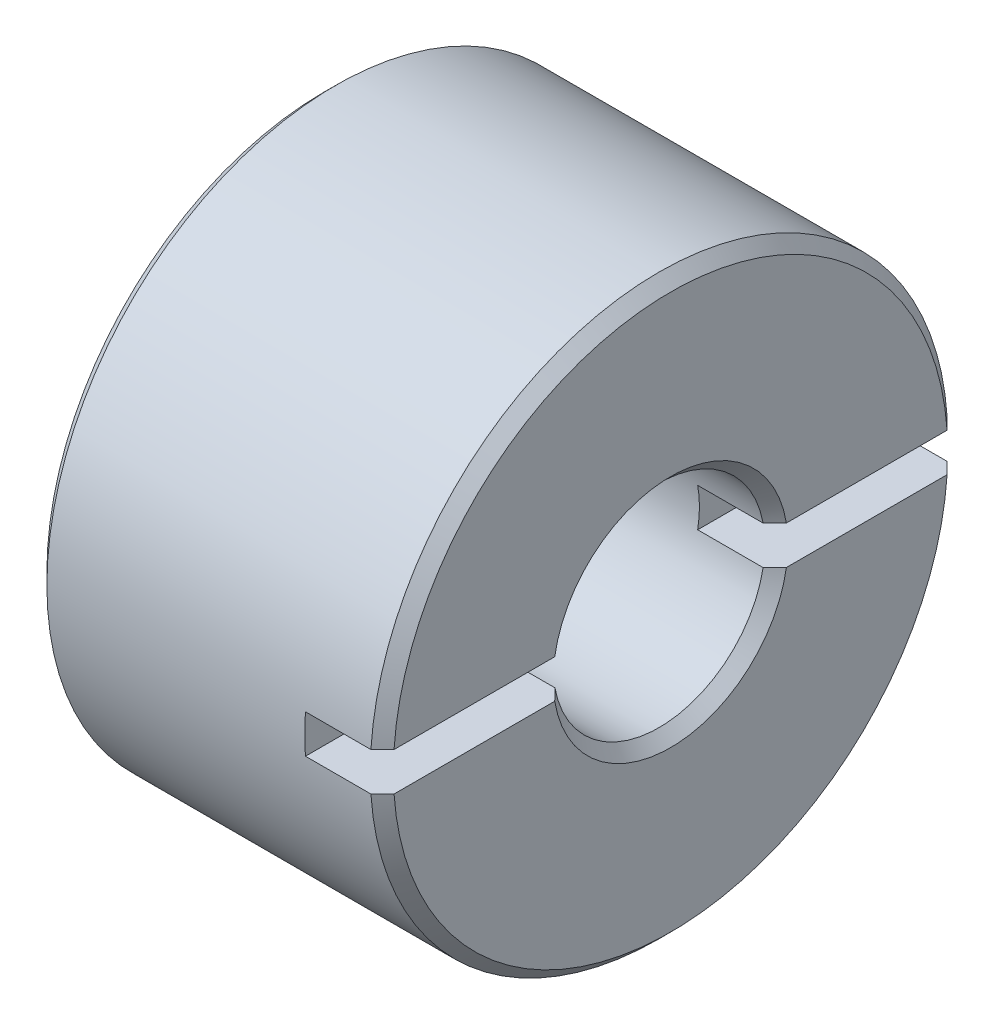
ISO-10303-21;
HEADER;
FILE_DESCRIPTION(('STEP AP214'),'2;1');
FILE_NAME('part.step','',(''),(''),'','','');
FILE_SCHEMA(('AUTOMOTIVE_DESIGN { 1 0 10303 214 1 1 1 1 }'));
ENDSEC;
DATA;
#1=APPLICATION_CONTEXT('core data for automotive mechanical design processes');
#2=APPLICATION_PROTOCOL_DEFINITION('international standard','automotive_design',2000,#1);
#3=PRODUCT_CONTEXT('',#1,'mechanical');
#4=PRODUCT('Part','Part','',(#3));
#5=PRODUCT_RELATED_PRODUCT_CATEGORY('part','',(#4));
#6=PRODUCT_DEFINITION_FORMATION('','',#4);
#7=PRODUCT_DEFINITION_CONTEXT('part definition',#1,'design');
#8=PRODUCT_DEFINITION('design','',#6,#7);
#9=PRODUCT_DEFINITION_SHAPE('','',#8);
#10=(LENGTH_UNIT() NAMED_UNIT(*) SI_UNIT(.MILLI.,.METRE.));
#11=(NAMED_UNIT(*) PLANE_ANGLE_UNIT() SI_UNIT($,.RADIAN.));
#12=(NAMED_UNIT(*) SI_UNIT($,.STERADIAN.) SOLID_ANGLE_UNIT());
#13=UNCERTAINTY_MEASURE_WITH_UNIT(LENGTH_MEASURE(1.E-05),#10,'distance_accuracy_value','');
#14=(GEOMETRIC_REPRESENTATION_CONTEXT(3) GLOBAL_UNCERTAINTY_ASSIGNED_CONTEXT((#13)) GLOBAL_UNIT_ASSIGNED_CONTEXT((#10,
#11,#12)) REPRESENTATION_CONTEXT('',''));
#15=CARTESIAN_POINT('',(0.,0.,0.));
#16=DIRECTION('',(0.,0.,1.));
#17=DIRECTION('',(1.,0.,0.));
#18=AXIS2_PLACEMENT_3D('',#15,#16,#17);
#19=CARTESIAN_POINT('',(11.,0.5,-9.000005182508));
#20=DIRECTION('',(-1.,0.,0.));
#21=DIRECTION('',(0.,0.,1.));
#22=AXIS2_PLACEMENT_3D('',#19,#20,#21);
#23=PLANE('',#22);
#24=DIRECTION('',(0.,0.,1.));
#25=VECTOR('',#24,1.);
#26=CARTESIAN_POINT('',(11.,0.5,-9.000005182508));
#27=LINE('',#26,#25);
#28=CARTESIAN_POINT('',(11.,0.5,-7.48331477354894));
#29=VERTEX_POINT('',#28);
#30=CARTESIAN_POINT('',(11.,0.5,-2.704163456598));
#31=VERTEX_POINT('',#30);
#32=EDGE_CURVE('E148',#29,#31,#27,.T.);
#33=ORIENTED_EDGE('',*,*,#32,.T.);
#34=CARTESIAN_POINT('',(11.,0.,0.));
#35=DIRECTION('',(-1.,0.,0.));
#36=DIRECTION('',(0.,0.,1.));
#37=AXIS2_PLACEMENT_3D('',#34,#35,#36);
#38=CIRCLE('',#37,2.75);
#39=CARTESIAN_POINT('',(11.,-0.5,-2.70416313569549));
#40=VERTEX_POINT('',#39);
#41=EDGE_CURVE('E112',#31,#40,#38,.T.);
#42=ORIENTED_EDGE('',*,*,#41,.T.);
#43=DIRECTION('',(0.,0.,-1.));
#44=VECTOR('',#43,1.);
#45=CARTESIAN_POINT('',(11.,-0.5,-9.000005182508));
#46=LINE('',#45,#44);
#47=CARTESIAN_POINT('',(11.,-0.5,-7.48331477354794));
#48=VERTEX_POINT('',#47);
#49=EDGE_CURVE('E111',#40,#48,#46,.T.);
#50=ORIENTED_EDGE('',*,*,#49,.T.);
#51=CARTESIAN_POINT('',(11.,0.,0.));
#52=DIRECTION('',(-1.,0.,0.));
#53=DIRECTION('',(0.,0.,1.));
#54=AXIS2_PLACEMENT_3D('',#51,#52,#53);
#55=CIRCLE('',#54,7.5);
#56=EDGE_CURVE('E20',#29,#48,#55,.T.);
#57=ORIENTED_EDGE('',*,*,#56,.F.);
#58=EDGE_LOOP('',(#33,#42,#50,#57));
#59=FACE_BOUND('',#58,.T.);
#60=ADVANCED_FACE('F16',(#59),#23,.F.);
#61=CARTESIAN_POINT('',(11.,0.5,-9.000005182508));
#62=DIRECTION('',(-1.,0.,0.));
#63=DIRECTION('',(0.,0.,1.));
#64=AXIS2_PLACEMENT_3D('',#61,#62,#63);
#65=PLANE('',#64);
#66=CARTESIAN_POINT('',(11.,0.,0.));
#67=DIRECTION('',(-1.,0.,0.));
#68=DIRECTION('',(0.,0.,1.));
#69=AXIS2_PLACEMENT_3D('',#66,#67,#68);
#70=CIRCLE('',#69,2.75);
#71=CARTESIAN_POINT('',(11.,-0.5,2.70416345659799));
#72=VERTEX_POINT('',#71);
#73=CARTESIAN_POINT('',(11.,0.5,2.7041633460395));
#74=VERTEX_POINT('',#73);
#75=EDGE_CURVE('E150',#72,#74,#70,.T.);
#76=ORIENTED_EDGE('',*,*,#75,.T.);
#77=DIRECTION('',(0.,0.,1.));
#78=VECTOR('',#77,1.);
#79=CARTESIAN_POINT('',(11.,0.5,-9.000005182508));
#80=LINE('',#79,#78);
#81=CARTESIAN_POINT('',(11.,0.5,7.48331477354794));
#82=VERTEX_POINT('',#81);
#83=EDGE_CURVE('E132',#74,#82,#80,.T.);
#84=ORIENTED_EDGE('',*,*,#83,.T.);
#85=CARTESIAN_POINT('',(11.,0.,0.));
#86=DIRECTION('',(-1.,0.,0.));
#87=DIRECTION('',(0.,0.,1.));
#88=AXIS2_PLACEMENT_3D('',#85,#86,#87);
#89=CIRCLE('',#88,7.5);
#90=CARTESIAN_POINT('',(11.,-0.5,7.48331469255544));
#91=VERTEX_POINT('',#90);
#92=EDGE_CURVE('E109',#91,#82,#89,.T.);
#93=ORIENTED_EDGE('',*,*,#92,.F.);
#94=DIRECTION('',(0.,0.,-1.));
#95=VECTOR('',#94,1.);
#96=CARTESIAN_POINT('',(11.,-0.5,-9.000005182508));
#97=LINE('',#96,#95);
#98=EDGE_CURVE('E289',#91,#72,#97,.T.);
#99=ORIENTED_EDGE('',*,*,#98,.T.);
#100=EDGE_LOOP('',(#76,#84,#93,#99));
#101=FACE_BOUND('',#100,.T.);
#102=ADVANCED_FACE('F340',(#101),#65,.F.);
#103=CARTESIAN_POINT('',(13.45,0.,0.));
#104=DIRECTION('',(-1.,0.,0.));
#105=DIRECTION('',(0.,0.,1.));
#106=AXIS2_PLACEMENT_3D('',#103,#104,#105);
#107=CYLINDRICAL_SURFACE('',#106,2.75);
#108=CARTESIAN_POINT('',(6.437196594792,0.,0.));
#109=DIRECTION('',(-1.,0.,0.));
#110=DIRECTION('',(0.,0.,1.));
#111=AXIS2_PLACEMENT_3D('',#108,#109,#110);
#112=CIRCLE('',#111,2.75);
#113=CARTESIAN_POINT('',(6.437196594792,0.,2.75));
#114=VERTEX_POINT('',#113);
#115=EDGE_CURVE('E305',#114,#114,#112,.T.);
#116=ORIENTED_EDGE('',*,*,#115,.T.);
#117=EDGE_LOOP('',(#116));
#118=FACE_BOUND('',#117,.T.);
#119=DIRECTION('',(1.,0.,0.));
#120=VECTOR('',#119,1.);
#121=CARTESIAN_POINT('',(13.,0.5,2.704163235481));
#122=LINE('',#121,#120);
#123=CARTESIAN_POINT('',(12.7000009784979,0.5,2.70416318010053));
#124=VERTEX_POINT('',#123);
#125=EDGE_CURVE('E129',#124,#74,#122,.F.);
#126=ORIENTED_EDGE('',*,*,#125,.T.);
#127=ORIENTED_EDGE('',*,*,#75,.F.);
#128=DIRECTION('',(1.,0.,0.));
#129=VECTOR('',#128,1.);
#130=CARTESIAN_POINT('',(11.,-0.5,2.704163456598));
#131=LINE('',#130,#129);
#132=CARTESIAN_POINT('',(12.7000011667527,-0.5,2.70416331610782));
#133=VERTEX_POINT('',#132);
#134=EDGE_CURVE('E124',#72,#133,#131,.T.);
#135=ORIENTED_EDGE('',*,*,#134,.T.);
#136=CARTESIAN_POINT('',(12.7000009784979,0.,0.));
#137=DIRECTION('',(1.,0.,0.));
#138=DIRECTION('',(0.,0.,-1.));
#139=AXIS2_PLACEMENT_3D('',#136,#137,#138);
#140=CIRCLE('',#139,2.74999967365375);
#141=CARTESIAN_POINT('',(12.7000008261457,-0.5,-2.70416296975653));
#142=VERTEX_POINT('',#141);
#143=EDGE_CURVE('E249',#133,#142,#140,.T.);
#144=ORIENTED_EDGE('',*,*,#143,.T.);
#145=DIRECTION('',(1.,0.,0.));
#146=VECTOR('',#145,1.);
#147=CARTESIAN_POINT('',(11.,-0.5,-2.704162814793));
#148=LINE('',#147,#146);
#149=EDGE_CURVE('E116',#142,#40,#148,.F.);
#150=ORIENTED_EDGE('',*,*,#149,.T.);
#151=ORIENTED_EDGE('',*,*,#41,.F.);
#152=DIRECTION('',(1.,0.,0.));
#153=VECTOR('',#152,1.);
#154=CARTESIAN_POINT('',(13.,0.5,-2.704163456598));
#155=LINE('',#154,#153);
#156=CARTESIAN_POINT('',(12.7000011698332,0.5,-2.70416331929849));
#157=VERTEX_POINT('',#156);
#158=EDGE_CURVE('E145',#31,#157,#155,.T.);
#159=ORIENTED_EDGE('',*,*,#158,.T.);
#160=CARTESIAN_POINT('',(12.7000009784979,0.,0.));
#161=DIRECTION('',(1.,0.,0.));
#162=DIRECTION('',(0.,0.,-1.));
#163=AXIS2_PLACEMENT_3D('',#160,#161,#162);
#164=CIRCLE('',#163,2.74999967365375);
#165=EDGE_CURVE('E139',#157,#124,#164,.T.);
#166=ORIENTED_EDGE('',*,*,#165,.T.);
#167=EDGE_LOOP('',(#126,#127,#135,#144,#150,#151,#159,#166));
#168=FACE_BOUND('',#167,.T.);
#169=ADVANCED_FACE('F213',(#118,#168),#107,.F.);
#170=CARTESIAN_POINT('',(13.,0.5,-9.000005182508));
#171=DIRECTION('',(0.,1.,0.));
#172=DIRECTION('',(0.,0.,1.));
#173=AXIS2_PLACEMENT_3D('',#170,#171,#172);
#174=PLANE('',#173);
#175=DIRECTION('',(0.,0.,1.));
#176=VECTOR('',#175,1.);
#177=CARTESIAN_POINT('',(13.,0.5,0.));
#178=LINE('',#177,#176);
#179=CARTESIAN_POINT('',(13.0000000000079,0.5,-7.18261678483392));
#180=VERTEX_POINT('',#179);
#181=CARTESIAN_POINT('',(13.0000000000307,0.5,-3.00873580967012));
#182=VERTEX_POINT('',#181);
#183=EDGE_CURVE('E302',#180,#182,#178,.T.);
#184=ORIENTED_EDGE('',*,*,#183,.T.);
#185=CARTESIAN_POINT('',(13.000000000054,0.5000000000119,-3.00873580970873));
#186=CARTESIAN_POINT('',(12.9499598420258,0.50000000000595,-2.95801343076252));
#187=CARTESIAN_POINT('',(12.8999398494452,0.500000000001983,-2.90727118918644));
#188=CARTESIAN_POINT('',(12.7999401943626,0.499999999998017,-2.80574697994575));
#189=CARTESIAN_POINT('',(12.7499605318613,0.499999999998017,-2.75496501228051));
#190=CARTESIAN_POINT('',(12.7000010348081,0.5,-2.70416318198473));
#191=B_SPLINE_CURVE_WITH_KNOTS('',3,(#185,#186,#187,#188,#189,#190),.UNSPECIFIED.,.F.,.F.,(4,2,
4),(0.,0.213754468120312,0.427508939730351),.UNSPECIFIED.);
#192=EDGE_CURVE('E141',#182,#157,#191,.T.);
#193=ORIENTED_EDGE('',*,*,#192,.T.);
#194=ORIENTED_EDGE('',*,*,#158,.F.);
#195=ORIENTED_EDGE('',*,*,#32,.F.);
#196=DIRECTION('',(1.,0.,0.));
#197=VECTOR('',#196,1.);
#198=CARTESIAN_POINT('',(13.,0.5,-7.48331477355));
#199=LINE('',#198,#197);
#200=CARTESIAN_POINT('',(12.6999988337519,0.5,-7.48331477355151));
#201=VERTEX_POINT('',#200);
#202=EDGE_CURVE('E105',#201,#29,#199,.F.);
#203=ORIENTED_EDGE('',*,*,#202,.F.);
#204=CARTESIAN_POINT('',(13.0000000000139,0.5,-7.18261678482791));
#205=CARTESIAN_POINT('',(12.9500021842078,0.5,-7.23273548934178));
#206=CARTESIAN_POINT('',(12.900003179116,0.5,-7.2828530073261));
#207=CARTESIAN_POINT('',(12.8000027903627,0.5,-7.38308567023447));
#208=CARTESIAN_POINT('',(12.750001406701,0.5,-7.43320081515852));
#209=CARTESIAN_POINT('',(12.6999988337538,0.5,-7.48331477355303));
#210=B_SPLINE_CURVE_WITH_KNOTS('',3,(#204,#205,#206,#207,#208,#209),.UNSPECIFIED.,.F.,.F.,(4,2,
4),(0.,0.212379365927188,0.424758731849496),.UNSPECIFIED.);
#211=EDGE_CURVE('E147',#180,#201,#210,.T.);
#212=ORIENTED_EDGE('',*,*,#211,.F.);
#213=EDGE_LOOP('',(#184,#193,#194,#195,#203,#212));
#214=FACE_BOUND('',#213,.T.);
#215=ADVANCED_FACE('F208',(#214),#174,.F.);
#216=CARTESIAN_POINT('',(13.0000000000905,0.,0.));
#217=DIRECTION('',(1.,0.,0.));
#218=DIRECTION('',(0.,0.,-1.));
#219=AXIS2_PLACEMENT_3D('',#216,#217,#218);
#220=CONICAL_SURFACE('',#219,3.04999855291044,0.785397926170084);
#221=ORIENTED_EDGE('',*,*,#165,.F.);
#222=ORIENTED_EDGE('',*,*,#192,.F.);
#223=CARTESIAN_POINT('',(13.0000000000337,0.,0.));
#224=DIRECTION('',(1.,0.,0.));
#225=DIRECTION('',(0.,0.,-1.));
#226=AXIS2_PLACEMENT_3D('',#223,#224,#225);
#227=CIRCLE('',#226,3.04999855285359);
#228=CARTESIAN_POINT('',(13.0000000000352,0.5,3.00873580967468));
#229=VERTEX_POINT('',#228);
#230=EDGE_CURVE('E304',#182,#229,#227,.T.);
#231=ORIENTED_EDGE('',*,*,#230,.T.);
#232=CARTESIAN_POINT('',(13.0000000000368,0.5,3.0087358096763));
#233=CARTESIAN_POINT('',(12.9499598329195,0.5,2.95801342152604));
#234=CARTESIAN_POINT('',(12.8999398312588,0.5,2.90727117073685));
#235=CARTESIAN_POINT('',(12.7999401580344,0.5,2.8057469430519));
#236=CARTESIAN_POINT('',(12.7499604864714,0.5,2.75496496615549));
#237=CARTESIAN_POINT('',(12.7000009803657,0.5,2.7041631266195));
#238=B_SPLINE_CURVE_WITH_KNOTS('',3,(#232,#233,#234,#235,#236,#237),.UNSPECIFIED.,.F.,.F.,(4,2,
4),(0.,0.213754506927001,0.42750901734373),.UNSPECIFIED.);
#239=EDGE_CURVE('E133',#229,#124,#238,.T.);
#240=ORIENTED_EDGE('',*,*,#239,.T.);
#241=EDGE_LOOP('',(#221,#222,#231,#240));
#242=FACE_BOUND('',#241,.T.);
#243=ADVANCED_FACE('F212',(#242),#220,.F.);
#244=CARTESIAN_POINT('',(13.,0.5,-9.000005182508));
#245=DIRECTION('',(0.,1.,0.));
#246=DIRECTION('',(0.,0.,1.));
#247=AXIS2_PLACEMENT_3D('',#244,#245,#246);
#248=PLANE('',#247);
#249=ORIENTED_EDGE('',*,*,#125,.F.);
#250=ORIENTED_EDGE('',*,*,#239,.F.);
#251=DIRECTION('',(0.,0.,1.));
#252=VECTOR('',#251,1.);
#253=CARTESIAN_POINT('',(13.,0.5,0.));
#254=LINE('',#253,#252);
#255=CARTESIAN_POINT('',(13.0000000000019,0.5,7.18261678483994));
#256=VERTEX_POINT('',#255);
#257=EDGE_CURVE('E300',#229,#256,#254,.T.);
#258=ORIENTED_EDGE('',*,*,#257,.T.);
#259=CARTESIAN_POINT('',(12.6999988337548,0.5,7.48331477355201));
#260=CARTESIAN_POINT('',(12.7500014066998,0.5,7.43320081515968));
#261=CARTESIAN_POINT('',(12.8000027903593,0.5,7.3830856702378));
#262=CARTESIAN_POINT('',(12.9000031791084,0.5,7.28285300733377));
#263=CARTESIAN_POINT('',(12.9500021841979,0.5,7.23273548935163));
#264=CARTESIAN_POINT('',(13.0000000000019,0.5,7.18261678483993));
#265=B_SPLINE_CURVE_WITH_KNOTS('',3,(#259,#260,#261,#262,#263,#264),.UNSPECIFIED.,.F.,.F.,(4,2,
4),(0.,0.212379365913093,0.424758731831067),.UNSPECIFIED.);
#266=CARTESIAN_POINT('',(12.6999988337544,0.5,7.48331477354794));
#267=VERTEX_POINT('',#266);
#268=EDGE_CURVE('E138',#267,#256,#265,.T.);
#269=ORIENTED_EDGE('',*,*,#268,.F.);
#270=DIRECTION('',(1.,0.,0.));
#271=VECTOR('',#270,1.);
#272=CARTESIAN_POINT('',(13.,0.5,7.483314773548));
#273=LINE('',#272,#271);
#274=EDGE_CURVE('E136',#82,#267,#273,.T.);
#275=ORIENTED_EDGE('',*,*,#274,.F.);
#276=ORIENTED_EDGE('',*,*,#83,.F.);
#277=EDGE_LOOP('',(#249,#250,#258,#269,#275,#276));
#278=FACE_BOUND('',#277,.T.);
#279=ADVANCED_FACE('F219',(#278),#248,.F.);
#280=CARTESIAN_POINT('',(11.,-0.5,-9.000005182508));
#281=DIRECTION('',(0.,-1.,0.));
#282=DIRECTION('',(0.,0.,-1.));
#283=AXIS2_PLACEMENT_3D('',#280,#281,#282);
#284=PLANE('',#283);
#285=DIRECTION('',(1.,0.,0.));
#286=VECTOR('',#285,1.);
#287=CARTESIAN_POINT('',(11.,-0.5,-7.483314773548));
#288=LINE('',#287,#286);
#289=CARTESIAN_POINT('',(12.6999990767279,-0.5,-7.48331477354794));
#290=VERTEX_POINT('',#289);
#291=EDGE_CURVE('E101',#48,#290,#288,.T.);
#292=ORIENTED_EDGE('',*,*,#291,.F.);
#293=ORIENTED_EDGE('',*,*,#49,.F.);
#294=ORIENTED_EDGE('',*,*,#149,.F.);
#295=CARTESIAN_POINT('',(12.7000007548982,-0.499999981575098,-2.70416287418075));
#296=CARTESIAN_POINT('',(12.7499602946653,-0.499999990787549,-2.75496475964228));
#297=CARTESIAN_POINT('',(12.7999400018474,-0.499999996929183,-2.80574678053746));
#298=CARTESIAN_POINT('',(12.8999397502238,-0.500000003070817,-2.90727109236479));
#299=CARTESIAN_POINT('',(12.9499597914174,-0.500000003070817,-2.95801338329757));
#300=CARTESIAN_POINT('',(13.0000000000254,-0.5,-3.00873580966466));
#301=B_SPLINE_CURVE_WITH_KNOTS('',3,(#295,#296,#297,#298,#299,#300),.UNSPECIFIED.,.F.,.F.,(4,2,
4),(0.,0.213754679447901,0.427509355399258),.UNSPECIFIED.);
#302=CARTESIAN_POINT('',(13.0000000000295,-0.49999999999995,-3.00873580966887));
#303=VERTEX_POINT('',#302);
#304=EDGE_CURVE('E242',#142,#303,#301,.T.);
#305=ORIENTED_EDGE('',*,*,#304,.T.);
#306=DIRECTION('',(0.,0.,1.));
#307=VECTOR('',#306,1.);
#308=CARTESIAN_POINT('',(13.,-0.4999999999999,0.));
#309=LINE('',#308,#307);
#310=CARTESIAN_POINT('',(13.0000000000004,-0.49999999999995,-7.18261678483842));
#311=VERTEX_POINT('',#310);
#312=EDGE_CURVE('E297',#303,#311,#309,.F.);
#313=ORIENTED_EDGE('',*,*,#312,.T.);
#314=CARTESIAN_POINT('',(12.6999989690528,-0.500000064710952,-7.48331472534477));
#315=CARTESIAN_POINT('',(12.7500015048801,-0.500000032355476,-7.43320076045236));
#316=CARTESIAN_POINT('',(12.8000028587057,-0.500000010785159,-7.38308561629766));
#317=CARTESIAN_POINT('',(12.9000032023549,-0.499999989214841,-7.2828529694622));
#318=CARTESIAN_POINT('',(12.9500021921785,-0.499999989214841,-7.23273546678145));
#319=CARTESIAN_POINT('',(13.0000000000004,-0.5,-7.18261678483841));
#320=B_SPLINE_CURVE_WITH_KNOTS('',3,(#314,#315,#316,#317,#318,#319),.UNSPECIFIED.,.F.,.F.,(4,2,
4),(0.,0.212379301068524,0.424758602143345),.UNSPECIFIED.);
#321=EDGE_CURVE('E122',#290,#311,#320,.T.);
#322=ORIENTED_EDGE('',*,*,#321,.F.);
#323=EDGE_LOOP('',(#292,#293,#294,#305,#313,#322));
#324=FACE_BOUND('',#323,.T.);
#325=ADVANCED_FACE('F119',(#324),#284,.F.);
#326=CARTESIAN_POINT('',(11.,-0.5,-9.000005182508));
#327=DIRECTION('',(0.,-1.,0.));
#328=DIRECTION('',(0.,0.,-1.));
#329=AXIS2_PLACEMENT_3D('',#326,#327,#328);
#330=PLANE('',#329);
#331=DIRECTION('',(1.,0.,0.));
#332=VECTOR('',#331,1.);
#333=CARTESIAN_POINT('',(11.,-0.5,7.483314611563));
#334=LINE('',#333,#332);
#335=CARTESIAN_POINT('',(12.6999993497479,-0.5,7.48331450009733));
#336=VERTEX_POINT('',#335);
#337=EDGE_CURVE('E285',#336,#91,#334,.F.);
#338=ORIENTED_EDGE('',*,*,#337,.F.);
#339=CARTESIAN_POINT('',(13.0000000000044,-0.5,7.1826167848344));
#340=CARTESIAN_POINT('',(12.9500022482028,-0.5,7.23273542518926));
#341=CARTESIAN_POINT('',(12.9000033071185,-0.5,7.28285287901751));
#342=CARTESIAN_POINT('',(12.8000030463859,-0.5,7.38308541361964));
#343=CARTESIAN_POINT('',(12.7500017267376,-0.5,7.43320049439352));
#344=CARTESIAN_POINT('',(12.6999992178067,-0.5,7.48331438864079));
#345=B_SPLINE_CURVE_WITH_KNOTS('',3,(#339,#340,#341,#342,#343,#344),.UNSPECIFIED.,.F.,.F.,(4,2,
4),(0.,0.212379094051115,0.424758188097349),.UNSPECIFIED.);
#346=CARTESIAN_POINT('',(13.0000000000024,-0.5,7.18261678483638));
#347=VERTEX_POINT('',#346);
#348=EDGE_CURVE('E35',#347,#336,#345,.T.);
#349=ORIENTED_EDGE('',*,*,#348,.F.);
#350=DIRECTION('',(0.,0.,1.));
#351=VECTOR('',#350,1.);
#352=CARTESIAN_POINT('',(13.,-0.5,0.));
#353=LINE('',#352,#351);
#354=CARTESIAN_POINT('',(13.0000000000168,-0.5,3.00873580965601));
#355=VERTEX_POINT('',#354);
#356=EDGE_CURVE('E299',#347,#355,#353,.F.);
#357=ORIENTED_EDGE('',*,*,#356,.T.);
#358=CARTESIAN_POINT('',(13.0000000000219,-0.50000000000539,3.00873580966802));
#359=CARTESIAN_POINT('',(12.9499598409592,-0.500000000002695,2.95801342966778));
#360=CARTESIAN_POINT('',(12.8999398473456,-0.500000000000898,2.90727118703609));
#361=CARTESIAN_POINT('',(12.7999401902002,-0.499999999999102,2.80574697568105));
#362=CARTESIAN_POINT('',(12.7499605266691,-0.499999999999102,2.75496500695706));
#363=CARTESIAN_POINT('',(12.7000010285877,-0.5,2.70416317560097));
#364=B_SPLINE_CURVE_WITH_KNOTS('',3,(#358,#359,#360,#361,#362,#363),.UNSPECIFIED.,.F.,.F.,(4,2,
4),(0.,0.213754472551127,0.42750894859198),.UNSPECIFIED.);
#365=EDGE_CURVE('E248',#355,#133,#364,.T.);
#366=ORIENTED_EDGE('',*,*,#365,.T.);
#367=ORIENTED_EDGE('',*,*,#134,.F.);
#368=ORIENTED_EDGE('',*,*,#98,.F.);
#369=EDGE_LOOP('',(#338,#349,#357,#366,#367,#368));
#370=FACE_BOUND('',#369,.T.);
#371=ADVANCED_FACE('F239',(#370),#330,.F.);
#372=CARTESIAN_POINT('',(12.99999999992,0.,0.));
#373=DIRECTION('',(1.,0.,0.));
#374=DIRECTION('',(0.,0.,-1.));
#375=AXIS2_PLACEMENT_3D('',#372,#373,#374);
#376=CONICAL_SURFACE('',#375,3.04999855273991,0.785397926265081);
#377=CARTESIAN_POINT('',(13.0000000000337,0.,0.));
#378=DIRECTION('',(1.,0.,0.));
#379=DIRECTION('',(0.,0.,-1.));
#380=AXIS2_PLACEMENT_3D('',#377,#378,#379);
#381=CIRCLE('',#380,3.04999855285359);
#382=EDGE_CURVE('E167',#355,#303,#381,.T.);
#383=ORIENTED_EDGE('',*,*,#382,.T.);
#384=ORIENTED_EDGE('',*,*,#304,.F.);
#385=ORIENTED_EDGE('',*,*,#143,.F.);
#386=ORIENTED_EDGE('',*,*,#365,.F.);
#387=EDGE_LOOP('',(#383,#384,#385,#386));
#388=FACE_BOUND('',#387,.T.);
#389=ADVANCED_FACE('F254',(#388),#376,.F.);
#390=CARTESIAN_POINT('',(0.,0.,0.));
#391=DIRECTION('',(0.559427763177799,0.,0.828879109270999));
#392=DIRECTION('',(-0.828879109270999,0.,0.559427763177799));
#393=AXIS2_PLACEMENT_3D('',#390,#391,#392);
#394=SPHERICAL_SURFACE('',#393,7.);
#395=ORIENTED_EDGE('',*,*,#115,.F.);
#396=EDGE_LOOP('',(#395));
#397=FACE_BOUND('',#396,.T.);
#398=CARTESIAN_POINT('',(4.,5.74456264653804,0.));
#399=CARTESIAN_POINT('',(4.,5.74456175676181,0.16127300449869));
#400=CARTESIAN_POINT('',(4.,5.73776559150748,0.32257522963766));
#401=CARTESIAN_POINT('',(4.,5.71062034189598,0.644099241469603));
#402=CARTESIAN_POINT('',(4.,5.69026460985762,0.804320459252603));
#403=CARTESIAN_POINT('',(4.,5.63609257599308,1.12275840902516));
#404=CARTESIAN_POINT('',(4.,5.60225322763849,1.28097122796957));
#405=CARTESIAN_POINT('',(4.,5.52133976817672,1.5940381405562));
#406=CARTESIAN_POINT('',(4.,5.47426067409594,1.74889094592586));
#407=CARTESIAN_POINT('',(4.,5.36727226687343,2.05389270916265));
#408=CARTESIAN_POINT('',(4.,5.30737824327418,2.20404703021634));
#409=CARTESIAN_POINT('',(4.,5.17512802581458,2.49883105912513));
#410=CARTESIAN_POINT('',(4.,5.10276717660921,2.64345867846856));
#411=CARTESIAN_POINT('',(4.,4.94618722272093,2.92596817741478));
#412=CARTESIAN_POINT('',(4.,4.86197929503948,3.06385625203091));
#413=CARTESIAN_POINT('',(4.,4.68221138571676,3.33211312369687));
#414=CARTESIAN_POINT('',(4.,4.5866462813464,3.46247848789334));
#415=CARTESIAN_POINT('',(4.,4.38486595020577,3.71470538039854));
#416=CARTESIAN_POINT('',(4.,4.27864988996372,3.83656624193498));
#417=CARTESIAN_POINT('',(4.,4.05637948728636,4.07085339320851));
#418=CARTESIAN_POINT('',(4.,3.9403296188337,4.18328392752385));
#419=CARTESIAN_POINT('',(4.,3.69908019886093,4.39805732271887));
#420=CARTESIAN_POINT('',(4.,3.57387357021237,4.50039223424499));
#421=CARTESIAN_POINT('',(4.,3.31533005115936,4.6941101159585));
#422=CARTESIAN_POINT('',(4.,3.18199621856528,4.78549716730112));
#423=CARTESIAN_POINT('',(4.,2.90798975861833,4.95678546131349));
#424=CARTESIAN_POINT('',(4.,2.7673111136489,5.03667707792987));
#425=CARTESIAN_POINT('',(4.,2.47977211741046,5.18428753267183));
#426=CARTESIAN_POINT('',(4.,2.33291407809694,5.25201087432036));
#427=CARTESIAN_POINT('',(4.,2.03414934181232,5.37478342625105));
#428=CARTESIAN_POINT('',(4.,1.88224735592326,5.42984410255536));
#429=CARTESIAN_POINT('',(4.,1.57440342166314,5.52696042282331));
#430=CARTESIAN_POINT('',(4.,1.41846305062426,5.56902106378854));
#431=CARTESIAN_POINT('',(4.,1.10563559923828,5.63941014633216));
#432=CARTESIAN_POINT('',(4.,0.948786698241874,5.66790877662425));
#433=CARTESIAN_POINT('',(4.,0.633426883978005,5.71174852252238));
#434=CARTESIAN_POINT('',(4.,0.474918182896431,5.72710533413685));
#435=CARTESIAN_POINT('',(4.,0.236957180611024,5.74022145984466));
#436=CARTESIAN_POINT('',(4.,0.157743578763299,5.74294419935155));
#437=CARTESIAN_POINT('',(4.,-0.0805564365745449,5.74619817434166));
#438=CARTESIAN_POINT('',(4.,-0.239745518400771,5.74176130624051));
#439=CARTESIAN_POINT('',(4.,-0.557371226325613,5.71967861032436));
#440=CARTESIAN_POINT('',(4.,-0.715806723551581,5.70201697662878));
#441=CARTESIAN_POINT('',(4.,-1.03272871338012,5.65327377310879));
#442=CARTESIAN_POINT('',(4.,-1.19118880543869,5.62201981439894));
#443=CARTESIAN_POINT('',(4.,-1.50497400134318,5.54627039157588));
#444=CARTESIAN_POINT('',(4.,-1.66029787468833,5.50176983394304));
#445=CARTESIAN_POINT('',(4.,-1.96678747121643,5.39980124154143));
#446=CARTESIAN_POINT('',(4.,-2.1179492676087,5.34232140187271));
#447=CARTESIAN_POINT('',(4.,-2.41494554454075,5.21480247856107));
#448=CARTESIAN_POINT('',(4.,-2.56077802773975,5.14475874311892));
#449=CARTESIAN_POINT('',(4.,-2.84590052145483,4.9926880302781));
#450=CARTESIAN_POINT('',(4.,-2.98519582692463,4.91067098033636));
#451=CARTESIAN_POINT('',(4.,-3.25643275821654,4.73516089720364));
#452=CARTESIAN_POINT('',(4.,-3.38837161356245,4.64166358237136));
#453=CARTESIAN_POINT('',(4.,-3.64379837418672,4.44396161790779));
#454=CARTESIAN_POINT('',(4.,-3.76729294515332,4.3397655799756));
#455=CARTESIAN_POINT('',(4.,-4.00512333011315,4.1212949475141));
#456=CARTESIAN_POINT('',(4.,-4.11945497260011,4.00701581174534));
#457=CARTESIAN_POINT('',(4.,-4.33807252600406,3.7692447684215));
#458=CARTESIAN_POINT('',(4.,-4.44235952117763,3.64575385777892));
#459=CARTESIAN_POINT('',(4.,-4.64011566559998,3.39048409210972));
#460=CARTESIAN_POINT('',(4.,-4.73358968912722,3.25870901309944));
#461=CARTESIAN_POINT('',(4.,-4.90919986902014,2.98761867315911));
#462=CARTESIAN_POINT('',(4.,-4.99132441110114,2.84829588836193));
#463=CARTESIAN_POINT('',(4.,-5.14351014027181,2.56327769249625));
#464=CARTESIAN_POINT('',(4.,-5.21357583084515,2.41758468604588));
#465=CARTESIAN_POINT('',(4.,-5.34126604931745,2.12062122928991));
#466=CARTESIAN_POINT('',(4.,-5.39887431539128,1.96934378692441));
#467=CARTESIAN_POINT('',(4.,-5.5011041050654,1.66252493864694));
#468=CARTESIAN_POINT('',(4.,-5.54573056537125,1.50698517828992));
#469=CARTESIAN_POINT('',(4.,-5.62163336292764,1.19301166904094));
#470=CARTESIAN_POINT('',(4.,-5.65293571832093,1.03458419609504));
#471=CARTESIAN_POINT('',(4.,-5.7020818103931,0.71572347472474));
#472=CARTESIAN_POINT('',(4.,-5.71993327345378,0.555291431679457));
#473=CARTESIAN_POINT('',(4.,-5.73552311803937,0.328798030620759));
#474=CARTESIAN_POINT('',(4.,-5.73891223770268,0.263086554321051));
#475=CARTESIAN_POINT('',(4.,-5.74343219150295,0.131585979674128));
#476=CARTESIAN_POINT('',(4.,-5.74456302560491,0.0657968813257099));
#477=CARTESIAN_POINT('',(4.,-5.74456171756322,-0.161247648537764));
#478=CARTESIAN_POINT('',(4.,-5.73776686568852,-0.322542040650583));
#479=CARTESIAN_POINT('',(4.,-5.71062811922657,-0.644025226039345));
#480=CARTESIAN_POINT('',(4.,-5.69027893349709,-0.804213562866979));
#481=CARTESIAN_POINT('',(4.,-5.63612155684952,-1.12261076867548));
#482=CARTESIAN_POINT('',(4.,-5.60228852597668,-1.28081542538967));
#483=CARTESIAN_POINT('',(4.,-5.52137261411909,-1.59393027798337));
#484=CARTESIAN_POINT('',(4.,-5.47427933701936,-1.74883778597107));
#485=CARTESIAN_POINT('',(4.,-5.36728959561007,-2.05384326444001));
#486=CARTESIAN_POINT('',(4.,-5.3074170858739,-2.20394963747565));
#487=CARTESIAN_POINT('',(4.,-5.17521263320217,-2.49865327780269));
#488=CARTESIAN_POINT('',(4.,-5.1028750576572,-2.64324801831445));
#489=CARTESIAN_POINT('',(4.,-4.94627015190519,-2.92583454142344));
#490=CARTESIAN_POINT('',(4.,-4.86200228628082,-3.06382602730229));
#491=CARTESIAN_POINT('',(4.,-4.68217935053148,-3.33215684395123));
#492=CARTESIAN_POINT('',(4.,-4.58662939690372,-3.46249960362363));
#493=CARTESIAN_POINT('',(4.,-4.38482679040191,-3.71475432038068));
#494=CARTESIAN_POINT('',(4.,-4.2785673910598,-3.83666088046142));
#495=CARTESIAN_POINT('',(4.,-4.05626004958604,-4.07097160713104));
#496=CARTESIAN_POINT('',(4.,-3.94022165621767,-4.18338483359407));
#497=CARTESIAN_POINT('',(4.,-3.69903504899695,-4.39809271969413));
#498=CARTESIAN_POINT('',(4.,-3.57388256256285,-4.50038257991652));
#499=CARTESIAN_POINT('',(4.,-3.31537582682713,-4.69407873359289));
#500=CARTESIAN_POINT('',(3.99999999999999,-3.18201968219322,-4.78548249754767));
#501=CARTESIAN_POINT('',(3.99999999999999,-2.90812759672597,-4.95669929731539));
#502=CARTESIAN_POINT('',(4.,-2.76759415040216,-5.03651632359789));
#503=CARTESIAN_POINT('',(4.,-2.48025082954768,-5.18405719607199));
#504=CARTESIAN_POINT('',(4.,-2.33343866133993,-5.25177657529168));
#505=CARTESIAN_POINT('',(4.,-2.03468818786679,-5.37458064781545));
#506=CARTESIAN_POINT('',(4.00000000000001,-1.88275188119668,-5.42967020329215));
#507=CARTESIAN_POINT('',(3.99999999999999,-1.57472143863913,-5.52687479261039));
#508=CARTESIAN_POINT('',(3.99999999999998,-1.4186257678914,-5.56898496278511));
#509=CARTESIAN_POINT('',(3.99999999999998,-1.10350559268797,-5.63988890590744));
#510=CARTESIAN_POINT('',(3.99999999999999,-0.944482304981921,-5.66868808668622));
#511=CARTESIAN_POINT('',(4.00000000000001,-0.62450261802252,-5.71280066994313));
#512=CARTESIAN_POINT('',(4.,-0.463545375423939,-5.72810795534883));
#513=CARTESIAN_POINT('',(4.,-0.140913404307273,-5.7451056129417));
#514=CARTESIAN_POINT('',(4.00000000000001,0.0207613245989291,-5.74679597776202));
#515=CARTESIAN_POINT('',(3.99999999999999,0.343605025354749,-5.73655010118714));
#516=CARTESIAN_POINT('',(3.99999999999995,0.504774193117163,-5.72462003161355));
#517=CARTESIAN_POINT('',(3.99999999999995,0.825600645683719,-5.68722043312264));
#518=CARTESIAN_POINT('',(3.99999999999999,0.985257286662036,-5.66174538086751));
#519=CARTESIAN_POINT('',(4.00000000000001,1.30179703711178,-5.59744564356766));
#520=CARTESIAN_POINT('',(4.,1.45868116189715,-5.55862595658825));
#521=CARTESIAN_POINT('',(4.,1.76868163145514,-5.46789341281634));
#522=CARTESIAN_POINT('',(4.00000000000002,1.92179651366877,-5.4159755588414));
#523=CARTESIAN_POINT('',(3.99999999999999,2.22305170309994,-5.29944479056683));
#524=CARTESIAN_POINT('',(3.99999999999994,2.37119382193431,-5.23483655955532));
#525=CARTESIAN_POINT('',(3.99999999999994,2.66155899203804,-5.09334813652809));
#526=CARTESIAN_POINT('',(3.99999999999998,2.80378002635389,-5.01646380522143));
#527=CARTESIAN_POINT('',(4.00000000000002,3.08120629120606,-4.8510047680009));
#528=CARTESIAN_POINT('',(4.,3.21641313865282,-4.76243277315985));
#529=CARTESIAN_POINT('',(4.,3.47882580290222,-4.57425697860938));
#530=CARTESIAN_POINT('',(4.00000000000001,3.6060352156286,-4.47465819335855));
#531=CARTESIAN_POINT('',(3.99999999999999,3.8517349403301,-4.2650022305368));
#532=CARTESIAN_POINT('',(3.99999999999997,3.97021671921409,-4.15493505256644));
#533=CARTESIAN_POINT('',(3.99999999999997,4.19740888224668,-3.92528103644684));
#534=CARTESIAN_POINT('',(3.99999999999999,4.30612552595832,-3.80570039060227));
#535=CARTESIAN_POINT('',(4.00000000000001,4.51314768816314,-3.55775124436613));
#536=CARTESIAN_POINT('',(4.,4.61144847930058,-3.42937879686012));
#537=CARTESIAN_POINT('',(4.,4.79687991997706,-3.16481233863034));
#538=CARTESIAN_POINT('',(4.,4.88401099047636,-3.02861862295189));
#539=CARTESIAN_POINT('',(4.,5.04645081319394,-2.74943713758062));
#540=CARTESIAN_POINT('',(3.99999999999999,5.12176489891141,-2.60645247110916));
#541=CARTESIAN_POINT('',(3.99999999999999,5.26020245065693,-2.31439644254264));
#542=CARTESIAN_POINT('',(4.,5.32330466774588,-2.16531500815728));
#543=CARTESIAN_POINT('',(4.,5.4366605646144,-1.86248193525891));
#544=CARTESIAN_POINT('',(4.,5.4869246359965,-1.70873418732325));
#545=CARTESIAN_POINT('',(4.,5.57424364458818,-1.39780026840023));
#546=CARTESIAN_POINT('',(4.,5.61131943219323,-1.24061994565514));
#547=CARTESIAN_POINT('',(4.,5.67210194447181,-0.923728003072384));
#548=CARTESIAN_POINT('',(4.,5.69581264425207,-0.76401715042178));
#549=CARTESIAN_POINT('',(4.,5.72335329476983,-0.5033820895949));
#550=CARTESIAN_POINT('',(4.,5.73130431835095,-0.402875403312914));
#551=CARTESIAN_POINT('',(4.,5.74190927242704,-0.201582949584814));
#552=CARTESIAN_POINT('',(4.,5.74456320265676,-0.100797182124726));
#553=CARTESIAN_POINT('',(4.,5.74456264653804,0.));
#554=B_SPLINE_CURVE_WITH_KNOTS('',3,(#398,#399,#400,#401,#402,#403,#404,#405,#406,#407,#408,
#409,#410,#411,#412,#413,#414,#415,#416,#417,#418,#419,#420,#421,#422,#423,#424,#425,#426,#427,
#428,#429,#430,#431,#432,#433,#434,#435,#436,#437,#438,#439,#440,#441,#442,#443,#444,#445,#446,
#447,#448,#449,#450,#451,#452,#453,#454,#455,#456,#457,#458,#459,#460,#461,#462,#463,#464,#465,
#466,#467,#468,#469,#470,#471,#472,#473,#474,#475,#476,#477,#478,#479,#480,#481,#482,#483,#484,
#485,#486,#487,#488,#489,#490,#491,#492,#493,#494,#495,#496,#497,#498,#499,#500,#501,#502,#503,
#504,#505,#506,#507,#508,#509,#510,#511,#512,#513,#514,#515,#516,#517,#518,#519,#520,#521,#522,
#523,#524,#525,#526,#527,#528,#529,#530,#531,#532,#533,#534,#535,#536,#537,#538,#539,#540,#541,
#542,#543,#544,#545,#546,#547,#548,#549,#550,#551,#552,#553),.UNSPECIFIED.,.T.,.F.,(4,2,2,2,2,2,
2,2,2,2,2,2,2,2,2,2,2,2,2,2,2,2,2,2,2,2,2,2,2,2,2,2,2,2,2,2,2,2,2,2,2,2,2,2,2,2,2,2,2,2,2,2,2,2,
2,2,2,2,2,2,2,2,2,2,2,2,2,2,2,2,2,2,2,2,2,2,2,4),(0.,0.483726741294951,0.967690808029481,
1.45248565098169,1.93746319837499,2.42186531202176,2.90644870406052,3.39057794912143,
3.87492639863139,4.35931277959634,4.84347995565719,5.32802537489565,5.81238959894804,
6.29715708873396,6.78174479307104,7.26589196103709,7.74985279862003,8.22756890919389,
8.70471365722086,8.94244985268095,9.41959469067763,9.89731071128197,10.3812707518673,
10.8654171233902,11.3500056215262,11.8347739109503,12.3191425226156,12.8036923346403,
13.2878551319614,13.7722371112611,14.2565667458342,14.7406771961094,15.225279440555,
15.7097003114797,16.1947497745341,16.679614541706,17.1635281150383,17.6471635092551,
17.844528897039,18.0418942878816,18.5255753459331,19.0094453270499,19.4942108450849,
19.9793574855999,20.463602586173,20.9480670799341,21.4325533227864,21.9168206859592,
22.4013950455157,22.8855016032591,23.3698365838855,23.8542838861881,24.3385639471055,
24.8230224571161,25.307294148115,25.7917470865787,26.2760030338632,26.7604784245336,
27.2449540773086,27.7292102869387,28.2136641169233,28.6979366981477,29.1823943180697,
29.6666734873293,30.151116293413,30.635446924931,31.1195582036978,31.6041366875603,
32.0884023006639,32.572886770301,33.0573529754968,33.5415998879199,34.0266819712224,
34.5113701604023,34.995288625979,35.4790630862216,35.7813969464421,36.0837308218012),.UNSPECIFIED.);
#555=CARTESIAN_POINT('',(4.,5.74456264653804,0.));
#556=VERTEX_POINT('',#555);
#557=EDGE_CURVE('E160',#556,#556,#554,.T.);
#558=ORIENTED_EDGE('',*,*,#557,.F.);
#559=EDGE_LOOP('',(#558));
#560=FACE_BOUND('',#559,.T.);
#561=ADVANCED_FACE('F169',(#397,#560),#394,.F.);
#562=CARTESIAN_POINT('',(13.,0.,0.));
#563=DIRECTION('',(-1.,0.,0.));
#564=DIRECTION('',(0.,0.,1.));
#565=AXIS2_PLACEMENT_3D('',#562,#563,#564);
#566=PLANE('',#565);
#567=ORIENTED_EDGE('',*,*,#257,.F.);
#568=ORIENTED_EDGE('',*,*,#230,.F.);
#569=ORIENTED_EDGE('',*,*,#183,.F.);
#570=CARTESIAN_POINT('',(13.0000000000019,0.,0.));
#571=DIRECTION('',(-1.,0.,0.));
#572=DIRECTION('',(0.,0.,1.));
#573=AXIS2_PLACEMENT_3D('',#570,#571,#572);
#574=CIRCLE('',#573,7.19999888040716);
#575=EDGE_CURVE('E157',#256,#180,#574,.T.);
#576=ORIENTED_EDGE('',*,*,#575,.F.);
#577=EDGE_LOOP('',(#567,#568,#569,#576));
#578=FACE_BOUND('',#577,.T.);
#579=ADVANCED_FACE('F264',(#578),#566,.F.);
#580=CARTESIAN_POINT('',(13.,0.,0.));
#581=DIRECTION('',(-1.,0.,0.));
#582=DIRECTION('',(0.,0.,1.));
#583=AXIS2_PLACEMENT_3D('',#580,#581,#582);
#584=PLANE('',#583);
#585=ORIENTED_EDGE('',*,*,#356,.F.);
#586=CARTESIAN_POINT('',(13.0000000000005,0.,0.));
#587=DIRECTION('',(-1.,0.,0.));
#588=DIRECTION('',(0.,0.,1.));
#589=AXIS2_PLACEMENT_3D('',#586,#587,#588);
#590=CIRCLE('',#589,7.1999988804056);
#591=EDGE_CURVE('E154',#311,#347,#590,.T.);
#592=ORIENTED_EDGE('',*,*,#591,.F.);
#593=ORIENTED_EDGE('',*,*,#312,.F.);
#594=ORIENTED_EDGE('',*,*,#382,.F.);
#595=EDGE_LOOP('',(#585,#592,#593,#594));
#596=FACE_BOUND('',#595,.T.);
#597=ADVANCED_FACE('F180',(#596),#584,.F.);
#598=CARTESIAN_POINT('',(4.,0.,0.));
#599=DIRECTION('',(-1.,0.,0.));
#600=DIRECTION('',(0.,0.,1.));
#601=AXIS2_PLACEMENT_3D('',#598,#599,#600);
#602=PLANE('',#601);
#603=ORIENTED_EDGE('',*,*,#557,.T.);
#604=EDGE_LOOP('',(#603));
#605=FACE_BOUND('',#604,.T.);
#606=CARTESIAN_POINT('',(4.00000031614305,0.,0.));
#607=DIRECTION('',(1.,0.,0.));
#608=DIRECTION('',(0.,0.,-1.));
#609=AXIS2_PLACEMENT_3D('',#606,#607,#608);
#610=CIRCLE('',#609,7.19999905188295);
#611=CARTESIAN_POINT('',(4.00000031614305,0.,-7.19999905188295));
#612=VERTEX_POINT('',#611);
#613=EDGE_CURVE('E144',#612,#612,#610,.T.);
#614=ORIENTED_EDGE('',*,*,#613,.F.);
#615=EDGE_LOOP('',(#614));
#616=FACE_BOUND('',#615,.T.);
#617=ADVANCED_FACE('F174',(#605,#616),#602,.T.);
#618=CARTESIAN_POINT('',(12.6999988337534,0.,0.));
#619=DIRECTION('',(-1.,0.,0.));
#620=DIRECTION('',(0.,0.,1.));
#621=AXIS2_PLACEMENT_3D('',#618,#619,#620);
#622=CONICAL_SURFACE('',#621,7.50000000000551,0.785398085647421);
#623=ORIENTED_EDGE('',*,*,#575,.T.);
#624=ORIENTED_EDGE('',*,*,#211,.T.);
#625=CARTESIAN_POINT('',(12.69999883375,0.,0.));
#626=DIRECTION('',(-1.,0.,0.));
#627=DIRECTION('',(0.,0.,1.));
#628=AXIS2_PLACEMENT_3D('',#625,#626,#627);
#629=CIRCLE('',#628,7.5);
#630=EDGE_CURVE('E142',#267,#201,#629,.T.);
#631=ORIENTED_EDGE('',*,*,#630,.F.);
#632=ORIENTED_EDGE('',*,*,#268,.T.);
#633=EDGE_LOOP('',(#623,#624,#631,#632));
#634=FACE_BOUND('',#633,.T.);
#635=ADVANCED_FACE('F179',(#634),#622,.T.);
#636=CARTESIAN_POINT('',(12.6999992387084,0.,0.));
#637=DIRECTION('',(-1.,0.,0.));
#638=DIRECTION('',(0.,0.,1.));
#639=AXIS2_PLACEMENT_3D('',#636,#637,#638);
#640=CONICAL_SURFACE('',#639,7.49999959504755,0.78539808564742);
#641=ORIENTED_EDGE('',*,*,#348,.T.);
#642=CARTESIAN_POINT('',(12.6999993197,0.,0.));
#643=DIRECTION('',(-1.,0.,0.));
#644=DIRECTION('',(0.,0.,1.));
#645=AXIS2_PLACEMENT_3D('',#642,#643,#644);
#646=CIRCLE('',#645,7.5);
#647=EDGE_CURVE('E26',#290,#336,#646,.T.);
#648=ORIENTED_EDGE('',*,*,#647,.F.);
#649=ORIENTED_EDGE('',*,*,#321,.T.);
#650=ORIENTED_EDGE('',*,*,#591,.T.);
#651=EDGE_LOOP('',(#641,#648,#649,#650));
#652=FACE_BOUND('',#651,.T.);
#653=ADVANCED_FACE('F185',(#652),#640,.T.);
#654=CARTESIAN_POINT('',(4.30000099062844,0.,0.));
#655=DIRECTION('',(1.,0.,0.));
#656=DIRECTION('',(0.,0.,-1.));
#657=AXIS2_PLACEMENT_3D('',#654,#655,#656);
#658=CONICAL_SURFACE('',#657,7.49999967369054,0.785398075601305);
#659=CARTESIAN_POINT('',(4.300000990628,0.,0.));
#660=DIRECTION('',(-1.,0.,0.));
#661=DIRECTION('',(0.,0.,1.));
#662=AXIS2_PLACEMENT_3D('',#659,#660,#661);
#663=CIRCLE('',#662,7.5);
#664=CARTESIAN_POINT('',(4.300000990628,0.,7.5));
#665=VERTEX_POINT('',#664);
#666=EDGE_CURVE('E11',#665,#665,#663,.F.);
#667=ORIENTED_EDGE('',*,*,#666,.F.);
#668=EDGE_LOOP('',(#667));
#669=FACE_BOUND('',#668,.T.);
#670=ORIENTED_EDGE('',*,*,#613,.T.);
#671=EDGE_LOOP('',(#670));
#672=FACE_BOUND('',#671,.T.);
#673=ADVANCED_FACE('F268',(#669,#672),#658,.T.);
#674=CARTESIAN_POINT('',(13.45,0.,0.));
#675=DIRECTION('',(-1.,0.,0.));
#676=DIRECTION('',(0.,0.,1.));
#677=AXIS2_PLACEMENT_3D('',#674,#675,#676);
#678=CYLINDRICAL_SURFACE('',#677,7.5);
#679=ORIENTED_EDGE('',*,*,#666,.T.);
#680=EDGE_LOOP('',(#679));
#681=FACE_BOUND('',#680,.T.);
#682=ORIENTED_EDGE('',*,*,#337,.T.);
#683=ORIENTED_EDGE('',*,*,#92,.T.);
#684=ORIENTED_EDGE('',*,*,#274,.T.);
#685=ORIENTED_EDGE('',*,*,#630,.T.);
#686=ORIENTED_EDGE('',*,*,#202,.T.);
#687=ORIENTED_EDGE('',*,*,#56,.T.);
#688=ORIENTED_EDGE('',*,*,#291,.T.);
#689=ORIENTED_EDGE('',*,*,#647,.T.);
#690=EDGE_LOOP('',(#682,#683,#684,#685,#686,#687,#688,#689));
#691=FACE_BOUND('',#690,.T.);
#692=ADVANCED_FACE('F18',(#681,#691),#678,.T.);
#693=CLOSED_SHELL('',(#60,#102,#169,#215,#243,#279,#325,#371,#389,#561,#579,#597,#617,#635,#653,
#673,#692));
#694=MANIFOLD_SOLID_BREP('B1',#693);
#695=ADVANCED_BREP_SHAPE_REPRESENTATION('',(#18,#694),#14);
#696=SHAPE_DEFINITION_REPRESENTATION(#9,#695);
ENDSEC;
END-ISO-10303-21;
